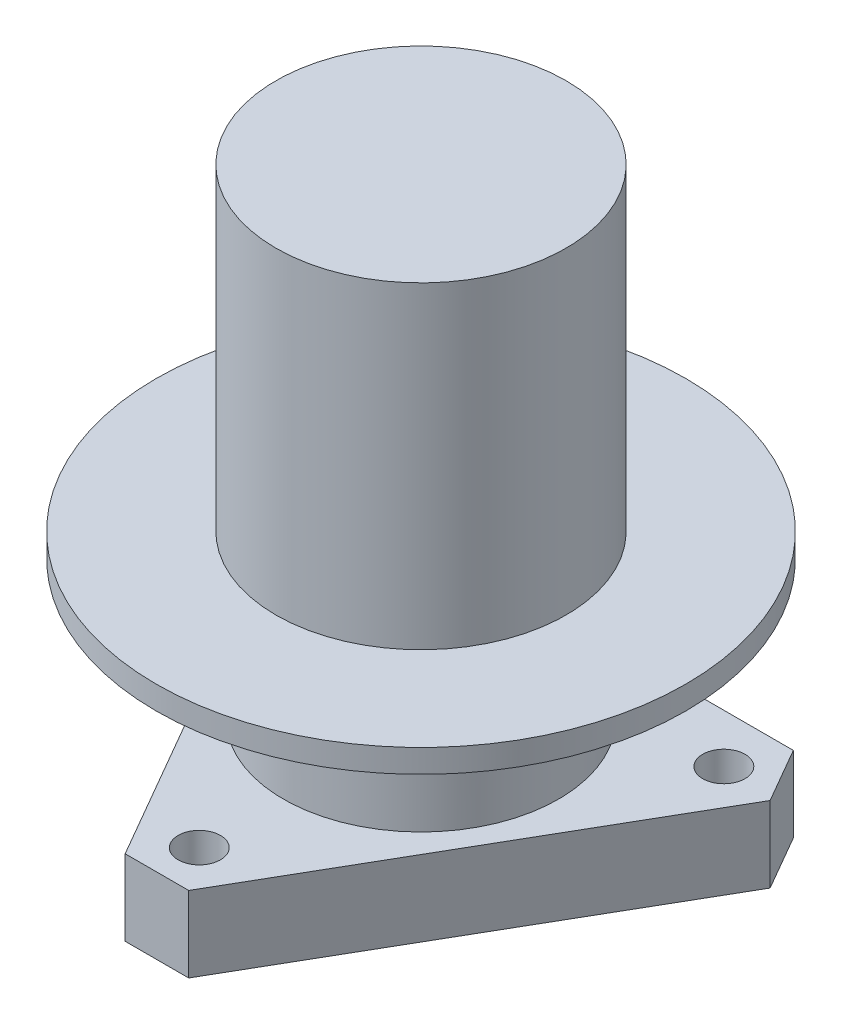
ISO-10303-21;
HEADER;
FILE_DESCRIPTION(('STEP AP214'),'2;1');
FILE_NAME('part.step','',(''),(''),'','','');
FILE_SCHEMA(('AUTOMOTIVE_DESIGN { 1 0 10303 214 1 1 1 1 }'));
ENDSEC;
DATA;
#1=APPLICATION_CONTEXT('core data for automotive mechanical design processes');
#2=APPLICATION_PROTOCOL_DEFINITION('international standard','automotive_design',2000,#1);
#3=PRODUCT_CONTEXT('',#1,'mechanical');
#4=PRODUCT('Part','Part','',(#3));
#5=PRODUCT_RELATED_PRODUCT_CATEGORY('part','',(#4));
#6=PRODUCT_DEFINITION_FORMATION('','',#4);
#7=PRODUCT_DEFINITION_CONTEXT('part definition',#1,'design');
#8=PRODUCT_DEFINITION('design','',#6,#7);
#9=PRODUCT_DEFINITION_SHAPE('','',#8);
#10=(LENGTH_UNIT() NAMED_UNIT(*) SI_UNIT(.MILLI.,.METRE.));
#11=(NAMED_UNIT(*) PLANE_ANGLE_UNIT() SI_UNIT($,.RADIAN.));
#12=(NAMED_UNIT(*) SI_UNIT($,.STERADIAN.) SOLID_ANGLE_UNIT());
#13=UNCERTAINTY_MEASURE_WITH_UNIT(LENGTH_MEASURE(1.E-05),#10,'distance_accuracy_value','');
#14=(GEOMETRIC_REPRESENTATION_CONTEXT(3) GLOBAL_UNCERTAINTY_ASSIGNED_CONTEXT((#13)) GLOBAL_UNIT_ASSIGNED_CONTEXT((#10,
#11,#12)) REPRESENTATION_CONTEXT('',''));
#15=CARTESIAN_POINT('',(0.,0.,0.));
#16=DIRECTION('',(0.,0.,1.));
#17=DIRECTION('',(1.,0.,0.));
#18=AXIS2_PLACEMENT_3D('',#15,#16,#17);
#19=CARTESIAN_POINT('',(0.,19.558,0.));
#20=DIRECTION('',(0.,1.,0.));
#21=DIRECTION('',(0.,0.,1.));
#22=AXIS2_PLACEMENT_3D('',#19,#20,#21);
#23=PLANE('',#22);
#24=CARTESIAN_POINT('',(0.,19.558,0.));
#25=DIRECTION('',(0.,1.,0.));
#26=DIRECTION('',(0.,0.,1.));
#27=AXIS2_PLACEMENT_3D('',#24,#25,#26);
#28=CIRCLE('',#27,31.75);
#29=CARTESIAN_POINT('',(0.,19.558,31.75));
#30=VERTEX_POINT('',#29);
#31=EDGE_CURVE('E43',#30,#30,#28,.T.);
#32=ORIENTED_EDGE('',*,*,#31,.T.);
#33=EDGE_LOOP('',(#32));
#34=FACE_BOUND('',#33,.T.);
#35=CARTESIAN_POINT('',(0.,19.558,0.));
#36=DIRECTION('',(0.,1.,0.));
#37=DIRECTION('',(0.,0.,1.));
#38=AXIS2_PLACEMENT_3D('',#35,#36,#37);
#39=CIRCLE('',#38,17.399);
#40=CARTESIAN_POINT('',(0.,19.558,-17.399));
#41=VERTEX_POINT('',#40);
#42=EDGE_CURVE('E148',#41,#41,#39,.T.);
#43=ORIENTED_EDGE('',*,*,#42,.F.);
#44=EDGE_LOOP('',(#43));
#45=FACE_BOUND('',#44,.T.);
#46=ADVANCED_FACE('F34',(#34,#45),#23,.T.);
#47=CARTESIAN_POINT('',(0.,16.764,0.));
#48=DIRECTION('',(0.,-1.,0.));
#49=DIRECTION('',(0.,0.,-1.));
#50=AXIS2_PLACEMENT_3D('',#47,#48,#49);
#51=CYLINDRICAL_SURFACE('',#50,16.51);
#52=CARTESIAN_POINT('',(0.,16.764,0.));
#53=DIRECTION('',(0.,1.,0.));
#54=DIRECTION('',(0.,0.,1.));
#55=AXIS2_PLACEMENT_3D('',#52,#53,#54);
#56=CIRCLE('',#55,16.51);
#57=CARTESIAN_POINT('',(0.,16.764,16.51));
#58=VERTEX_POINT('',#57);
#59=EDGE_CURVE('E11',#58,#58,#56,.T.);
#60=ORIENTED_EDGE('',*,*,#59,.F.);
#61=EDGE_LOOP('',(#60));
#62=FACE_BOUND('',#61,.T.);
#63=CARTESIAN_POINT('',(0.,0.,0.));
#64=DIRECTION('',(0.,-1.,0.));
#65=DIRECTION('',(0.,0.,-1.));
#66=AXIS2_PLACEMENT_3D('',#63,#64,#65);
#67=CIRCLE('',#66,16.51);
#68=CARTESIAN_POINT('',(0.,0.,-16.51));
#69=VERTEX_POINT('',#68);
#70=EDGE_CURVE('E140',#69,#69,#67,.T.);
#71=ORIENTED_EDGE('',*,*,#70,.F.);
#72=EDGE_LOOP('',(#71));
#73=FACE_BOUND('',#72,.T.);
#74=ADVANCED_FACE('F36',(#62,#73),#51,.T.);
#75=CARTESIAN_POINT('',(0.,16.764,0.));
#76=DIRECTION('',(0.,1.,0.));
#77=DIRECTION('',(0.,0.,1.));
#78=AXIS2_PLACEMENT_3D('',#75,#76,#77);
#79=PLANE('',#78);
#80=CARTESIAN_POINT('',(0.,16.764,0.));
#81=DIRECTION('',(0.,1.,0.));
#82=DIRECTION('',(0.,0.,1.));
#83=AXIS2_PLACEMENT_3D('',#80,#81,#82);
#84=CIRCLE('',#83,31.75);
#85=CARTESIAN_POINT('',(0.,16.764,31.75));
#86=VERTEX_POINT('',#85);
#87=EDGE_CURVE('E154',#86,#86,#84,.T.);
#88=ORIENTED_EDGE('',*,*,#87,.F.);
#89=EDGE_LOOP('',(#88));
#90=FACE_BOUND('',#89,.T.);
#91=ORIENTED_EDGE('',*,*,#59,.T.);
#92=EDGE_LOOP('',(#91));
#93=FACE_BOUND('',#92,.T.);
#94=ADVANCED_FACE('F165',(#90,#93),#79,.F.);
#95=CARTESIAN_POINT('',(0.,19.558,0.));
#96=DIRECTION('',(0.,-1.,0.));
#97=DIRECTION('',(0.,0.,-1.));
#98=AXIS2_PLACEMENT_3D('',#95,#96,#97);
#99=CYLINDRICAL_SURFACE('',#98,31.75);
#100=ORIENTED_EDGE('',*,*,#31,.F.);
#101=EDGE_LOOP('',(#100));
#102=FACE_BOUND('',#101,.T.);
#103=ORIENTED_EDGE('',*,*,#87,.T.);
#104=EDGE_LOOP('',(#103));
#105=FACE_BOUND('',#104,.T.);
#106=ADVANCED_FACE('F161',(#102,#105),#99,.T.);
#107=CARTESIAN_POINT('',(0.,57.658,0.));
#108=DIRECTION('',(0.,-1.,0.));
#109=DIRECTION('',(0.,0.,-1.));
#110=AXIS2_PLACEMENT_3D('',#107,#108,#109);
#111=CYLINDRICAL_SURFACE('',#110,17.399);
#112=CARTESIAN_POINT('',(0.,57.658,0.));
#113=DIRECTION('',(0.,1.,0.));
#114=DIRECTION('',(0.,0.,1.));
#115=AXIS2_PLACEMENT_3D('',#112,#113,#114);
#116=CIRCLE('',#115,17.399);
#117=CARTESIAN_POINT('',(0.,57.658,-17.399));
#118=VERTEX_POINT('',#117);
#119=EDGE_CURVE('E151',#118,#118,#116,.T.);
#120=CARTESIAN_POINT('',(0.,57.658,-17.399));
#121=CARTESIAN_POINT('',(0.,57.261125,-17.399));
#122=CARTESIAN_POINT('',(0.,56.86425,-17.399));
#123=CARTESIAN_POINT('',(0.,56.0705,-17.399));
#124=CARTESIAN_POINT('',(0.,55.673625,-17.399));
#125=CARTESIAN_POINT('',(0.,54.879875,-17.399));
#126=CARTESIAN_POINT('',(0.,54.483,-17.399));
#127=CARTESIAN_POINT('',(0.,53.68925,-17.399));
#128=CARTESIAN_POINT('',(0.,53.292375,-17.399));
#129=CARTESIAN_POINT('',(0.,52.498625,-17.399));
#130=CARTESIAN_POINT('',(0.,52.10175,-17.399));
#131=CARTESIAN_POINT('',(0.,51.308,-17.399));
#132=CARTESIAN_POINT('',(0.,50.911125,-17.399));
#133=CARTESIAN_POINT('',(0.,50.117375,-17.399));
#134=CARTESIAN_POINT('',(0.,49.7205,-17.399));
#135=CARTESIAN_POINT('',(0.,48.92675,-17.399));
#136=CARTESIAN_POINT('',(0.,48.529875,-17.399));
#137=CARTESIAN_POINT('',(0.,47.736125,-17.399));
#138=CARTESIAN_POINT('',(0.,47.33925,-17.399));
#139=CARTESIAN_POINT('',(0.,46.5455,-17.399));
#140=CARTESIAN_POINT('',(0.,46.148625,-17.399));
#141=CARTESIAN_POINT('',(0.,45.354875,-17.399));
#142=CARTESIAN_POINT('',(0.,44.958,-17.399));
#143=CARTESIAN_POINT('',(0.,44.16425,-17.399));
#144=CARTESIAN_POINT('',(0.,43.767375,-17.399));
#145=CARTESIAN_POINT('',(0.,42.973625,-17.399));
#146=CARTESIAN_POINT('',(0.,42.57675,-17.399));
#147=CARTESIAN_POINT('',(0.,41.783,-17.399));
#148=CARTESIAN_POINT('',(0.,41.386125,-17.399));
#149=CARTESIAN_POINT('',(0.,40.592375,-17.399));
#150=CARTESIAN_POINT('',(0.,40.1955,-17.399));
#151=CARTESIAN_POINT('',(0.,39.40175,-17.399));
#152=CARTESIAN_POINT('',(0.,39.004875,-17.399));
#153=CARTESIAN_POINT('',(0.,38.211125,-17.399));
#154=CARTESIAN_POINT('',(0.,37.81425,-17.399));
#155=CARTESIAN_POINT('',(0.,37.0205,-17.399));
#156=CARTESIAN_POINT('',(0.,36.623625,-17.399));
#157=CARTESIAN_POINT('',(0.,35.829875,-17.399));
#158=CARTESIAN_POINT('',(0.,35.433,-17.399));
#159=CARTESIAN_POINT('',(0.,34.63925,-17.399));
#160=CARTESIAN_POINT('',(0.,34.242375,-17.399));
#161=CARTESIAN_POINT('',(0.,33.448625,-17.399));
#162=CARTESIAN_POINT('',(0.,33.05175,-17.399));
#163=CARTESIAN_POINT('',(0.,32.258,-17.399));
#164=CARTESIAN_POINT('',(0.,31.861125,-17.399));
#165=CARTESIAN_POINT('',(0.,31.067375,-17.399));
#166=CARTESIAN_POINT('',(0.,30.6705,-17.399));
#167=CARTESIAN_POINT('',(0.,29.87675,-17.399));
#168=CARTESIAN_POINT('',(0.,29.479875,-17.399));
#169=CARTESIAN_POINT('',(0.,28.686125,-17.399));
#170=CARTESIAN_POINT('',(0.,28.28925,-17.399));
#171=CARTESIAN_POINT('',(0.,27.4955,-17.399));
#172=CARTESIAN_POINT('',(0.,27.098625,-17.399));
#173=CARTESIAN_POINT('',(0.,26.304875,-17.399));
#174=CARTESIAN_POINT('',(0.,25.908,-17.399));
#175=CARTESIAN_POINT('',(0.,25.11425,-17.399));
#176=CARTESIAN_POINT('',(0.,24.717375,-17.399));
#177=CARTESIAN_POINT('',(0.,23.923625,-17.399));
#178=CARTESIAN_POINT('',(0.,23.52675,-17.399));
#179=CARTESIAN_POINT('',(0.,22.733,-17.399));
#180=CARTESIAN_POINT('',(0.,22.336125,-17.399));
#181=CARTESIAN_POINT('',(0.,21.542375,-17.399));
#182=CARTESIAN_POINT('',(0.,21.1455,-17.399));
#183=CARTESIAN_POINT('',(0.,20.35175,-17.399));
#184=CARTESIAN_POINT('',(0.,19.954875,-17.399));
#185=CARTESIAN_POINT('',(0.,19.558,-17.399));
#186=B_SPLINE_CURVE_WITH_KNOTS('',3,(#120,#121,#122,#123,#124,#125,#126,#127,#128,#129,#130,
#131,#132,#133,#134,#135,#136,#137,#138,#139,#140,#141,#142,#143,#144,#145,#146,#147,#148,#149,
#150,#151,#152,#153,#154,#155,#156,#157,#158,#159,#160,#161,#162,#163,#164,#165,#166,#167,#168,
#169,#170,#171,#172,#173,#174,#175,#176,#177,#178,#179,#180,#181,#182,#183,#184,#185),
.UNSPECIFIED.,.F.,.F.,(4,2,2,2,2,2,2,2,2,2,2,2,2,2,2,2,2,2,2,2,2,2,2,2,2,2,2,2,2,2,2,2,4),(0.,
1.19062499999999,2.38124999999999,3.571875,4.7625,5.953125,7.14375,8.334375,9.525,10.715625,
11.90625,13.096875,14.2875,15.478125,16.66875,17.859375,19.05,20.240625,21.43125,22.621875,
23.8125,25.003125,26.19375,27.384375,28.575,29.765625,30.95625,32.146875,33.3375,34.528125,
35.71875,36.909375,38.1),.UNSPECIFIED.);
#187=EDGE_CURVE('BSEAM164',#118,#41,#186,.T.);
#188=ORIENTED_EDGE('',*,*,#119,.F.);
#189=ORIENTED_EDGE('',*,*,#42,.T.);
#190=ORIENTED_EDGE('',*,*,#187,.T.);
#191=ORIENTED_EDGE('',*,*,#187,.F.);
#192=EDGE_LOOP('',(#188,#190,#189,#191));
#193=FACE_BOUND('',#192,.T.);
#194=ADVANCED_FACE('F164',(#193),#111,.T.);
#195=CARTESIAN_POINT('',(0.,57.658,0.));
#196=DIRECTION('',(0.,1.,0.));
#197=DIRECTION('',(0.,0.,1.));
#198=AXIS2_PLACEMENT_3D('',#195,#196,#197);
#199=PLANE('',#198);
#200=ORIENTED_EDGE('',*,*,#119,.T.);
#201=EDGE_LOOP('',(#200));
#202=FACE_BOUND('',#201,.T.);
#203=ADVANCED_FACE('F180',(#202),#199,.T.);
#204=CARTESIAN_POINT('',(0.,0.,-63.3339242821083));
#205=DIRECTION('',(0.,-1.,0.));
#206=DIRECTION('',(0.,0.,-1.));
#207=AXIS2_PLACEMENT_3D('',#204,#205,#206);
#208=PLANE('',#207);
#209=CARTESIAN_POINT('',(23.0249846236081,0.,-13.2934810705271));
#210=DIRECTION('',(0.,-1.,0.));
#211=DIRECTION('',(0.,0.,-1.));
#212=AXIS2_PLACEMENT_3D('',#209,#210,#211);
#213=CIRCLE('',#212,2.54);
#214=CARTESIAN_POINT('',(23.0249846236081,0.,-15.8334810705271));
#215=VERTEX_POINT('',#214);
#216=EDGE_CURVE('E231',#215,#215,#213,.F.);
#217=ORIENTED_EDGE('',*,*,#216,.F.);
#218=EDGE_LOOP('',(#217));
#219=FACE_BOUND('',#218,.T.);
#220=CARTESIAN_POINT('',(-23.0249846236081,0.,-13.2934810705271));
#221=DIRECTION('',(0.,-1.,0.));
#222=DIRECTION('',(0.,0.,-1.));
#223=AXIS2_PLACEMENT_3D('',#220,#221,#222);
#224=CIRCLE('',#223,2.54);
#225=CARTESIAN_POINT('',(-23.0249846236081,0.,-15.8334810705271));
#226=VERTEX_POINT('',#225);
#227=EDGE_CURVE('E225',#226,#226,#224,.F.);
#228=ORIENTED_EDGE('',*,*,#227,.F.);
#229=EDGE_LOOP('',(#228));
#230=FACE_BOUND('',#229,.T.);
#231=CARTESIAN_POINT('',(0.,0.,26.5869621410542));
#232=DIRECTION('',(0.,-1.,0.));
#233=DIRECTION('',(0.,0.,-1.));
#234=AXIS2_PLACEMENT_3D('',#231,#232,#233);
#235=CIRCLE('',#234,2.54);
#236=CARTESIAN_POINT('',(0.,0.,24.0469621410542));
#237=VERTEX_POINT('',#236);
#238=EDGE_CURVE('E126',#237,#237,#235,.F.);
#239=ORIENTED_EDGE('',*,*,#238,.F.);
#240=EDGE_LOOP('',(#239));
#241=FACE_BOUND('',#240,.T.);
#242=DIRECTION('',(-0.5,0.,0.866025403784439));
#243=VECTOR('',#242,1.);
#244=CARTESIAN_POINT('',(-29.329393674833,0.,-12.5339242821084));
#245=LINE('',#244,#243);
#246=CARTESIAN_POINT('',(-25.519393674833,0.,-19.1330378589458));
#247=VERTEX_POINT('',#246);
#248=CARTESIAN_POINT('',(-29.329393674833,0.,-12.5339242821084));
#249=VERTEX_POINT('',#248);
#250=EDGE_CURVE('E122',#247,#249,#245,.T.);
#251=ORIENTED_EDGE('',*,*,#250,.T.);
#252=DIRECTION('',(0.5,0.,0.866025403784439));
#253=VECTOR('',#252,1.);
#254=CARTESIAN_POINT('',(-29.329393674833,0.,-12.5339242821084));
#255=LINE('',#254,#253);
#256=CARTESIAN_POINT('',(-3.81000000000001,0.,31.6669621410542));
#257=VERTEX_POINT('',#256);
#258=EDGE_CURVE('E125',#249,#257,#255,.T.);
#259=ORIENTED_EDGE('',*,*,#258,.T.);
#260=DIRECTION('',(1.,0.,0.));
#261=VECTOR('',#260,1.);
#262=CARTESIAN_POINT('',(-3.81000000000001,0.,31.6669621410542));
#263=LINE('',#262,#261);
#264=CARTESIAN_POINT('',(3.80999999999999,0.,31.6669621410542));
#265=VERTEX_POINT('',#264);
#266=EDGE_CURVE('E129',#257,#265,#263,.T.);
#267=ORIENTED_EDGE('',*,*,#266,.T.);
#268=DIRECTION('',(0.5,0.,-0.866025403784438));
#269=VECTOR('',#268,1.);
#270=CARTESIAN_POINT('',(3.80999999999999,0.,31.6669621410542));
#271=LINE('',#270,#269);
#272=CARTESIAN_POINT('',(29.329393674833,0.,-12.5339242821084));
#273=VERTEX_POINT('',#272);
#274=EDGE_CURVE('E132',#265,#273,#271,.T.);
#275=ORIENTED_EDGE('',*,*,#274,.T.);
#276=DIRECTION('',(-0.500000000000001,0.,-0.866025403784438));
#277=VECTOR('',#276,1.);
#278=CARTESIAN_POINT('',(25.519393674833,0.,-19.1330378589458));
#279=LINE('',#278,#277);
#280=CARTESIAN_POINT('',(25.519393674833,0.,-19.1330378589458));
#281=VERTEX_POINT('',#280);
#282=EDGE_CURVE('E99',#273,#281,#279,.T.);
#283=ORIENTED_EDGE('',*,*,#282,.T.);
#284=DIRECTION('',(-1.,0.,0.));
#285=VECTOR('',#284,1.);
#286=CARTESIAN_POINT('',(-25.519393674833,0.,-19.1330378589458));
#287=LINE('',#286,#285);
#288=EDGE_CURVE('E135',#281,#247,#287,.T.);
#289=ORIENTED_EDGE('',*,*,#288,.T.);
#290=EDGE_LOOP('',(#251,#259,#267,#275,#283,#289));
#291=FACE_BOUND('',#290,.T.);
#292=ORIENTED_EDGE('',*,*,#70,.T.);
#293=EDGE_LOOP('',(#292));
#294=FACE_BOUND('',#293,.T.);
#295=ADVANCED_FACE('F177',(#219,#230,#241,#291,#294),#208,.F.);
#296=CARTESIAN_POINT('',(-29.329393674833,-9.0932,-12.5339242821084));
#297=DIRECTION('',(-0.866025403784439,0.,-0.5));
#298=DIRECTION('',(-0.5,0.,0.866025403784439));
#299=AXIS2_PLACEMENT_3D('',#296,#297,#298);
#300=PLANE('',#299);
#301=ORIENTED_EDGE('',*,*,#250,.F.);
#302=DIRECTION('',(0.,1.,0.));
#303=VECTOR('',#302,1.);
#304=CARTESIAN_POINT('',(-25.519393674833,-9.0932,-19.1330378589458));
#305=LINE('',#304,#303);
#306=CARTESIAN_POINT('',(-25.519393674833,-9.0932,-19.1330378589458));
#307=VERTEX_POINT('',#306);
#308=EDGE_CURVE('E51',#307,#247,#305,.T.);
#309=ORIENTED_EDGE('',*,*,#308,.F.);
#310=DIRECTION('',(-0.5,0.,0.866025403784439));
#311=VECTOR('',#310,1.);
#312=CARTESIAN_POINT('',(-29.329393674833,-9.0932,-12.5339242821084));
#313=LINE('',#312,#311);
#314=CARTESIAN_POINT('',(-29.329393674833,-9.0932,-12.5339242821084));
#315=VERTEX_POINT('',#314);
#316=EDGE_CURVE('E138',#307,#315,#313,.T.);
#317=ORIENTED_EDGE('',*,*,#316,.T.);
#318=DIRECTION('',(0.,1.,0.));
#319=VECTOR('',#318,1.);
#320=CARTESIAN_POINT('',(-29.329393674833,-9.0932,-12.5339242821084));
#321=LINE('',#320,#319);
#322=EDGE_CURVE('E86',#315,#249,#321,.T.);
#323=ORIENTED_EDGE('',*,*,#322,.T.);
#324=EDGE_LOOP('',(#301,#309,#317,#323));
#325=FACE_BOUND('',#324,.T.);
#326=ADVANCED_FACE('F179',(#325),#300,.T.);
#327=CARTESIAN_POINT('',(-25.519393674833,-9.0932,-19.1330378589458));
#328=DIRECTION('',(0.,0.,-1.));
#329=DIRECTION('',(-1.,0.,0.));
#330=AXIS2_PLACEMENT_3D('',#327,#328,#329);
#331=PLANE('',#330);
#332=ORIENTED_EDGE('',*,*,#288,.F.);
#333=DIRECTION('',(0.,1.,0.));
#334=VECTOR('',#333,1.);
#335=CARTESIAN_POINT('',(25.519393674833,-9.0932,-19.1330378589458));
#336=LINE('',#335,#334);
#337=CARTESIAN_POINT('',(25.519393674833,-9.0932,-19.1330378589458));
#338=VERTEX_POINT('',#337);
#339=EDGE_CURVE('E74',#338,#281,#336,.T.);
#340=ORIENTED_EDGE('',*,*,#339,.F.);
#341=DIRECTION('',(-1.,0.,0.));
#342=VECTOR('',#341,1.);
#343=CARTESIAN_POINT('',(-25.519393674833,-9.0932,-19.1330378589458));
#344=LINE('',#343,#342);
#345=EDGE_CURVE('E112',#338,#307,#344,.T.);
#346=ORIENTED_EDGE('',*,*,#345,.T.);
#347=ORIENTED_EDGE('',*,*,#308,.T.);
#348=EDGE_LOOP('',(#332,#340,#346,#347));
#349=FACE_BOUND('',#348,.T.);
#350=ADVANCED_FACE('F187',(#349),#331,.T.);
#351=CARTESIAN_POINT('',(25.519393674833,-9.0932,-19.1330378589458));
#352=DIRECTION('',(0.866025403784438,0.,-0.500000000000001));
#353=DIRECTION('',(-0.500000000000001,0.,-0.866025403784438));
#354=AXIS2_PLACEMENT_3D('',#351,#352,#353);
#355=PLANE('',#354);
#356=ORIENTED_EDGE('',*,*,#282,.F.);
#357=DIRECTION('',(0.,1.,0.));
#358=VECTOR('',#357,1.);
#359=CARTESIAN_POINT('',(29.329393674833,-9.0932,-12.5339242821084));
#360=LINE('',#359,#358);
#361=CARTESIAN_POINT('',(29.329393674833,-9.0932,-12.5339242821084));
#362=VERTEX_POINT('',#361);
#363=EDGE_CURVE('E94',#362,#273,#360,.T.);
#364=ORIENTED_EDGE('',*,*,#363,.F.);
#365=DIRECTION('',(-0.500000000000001,0.,-0.866025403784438));
#366=VECTOR('',#365,1.);
#367=CARTESIAN_POINT('',(25.519393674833,-9.0932,-19.1330378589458));
#368=LINE('',#367,#366);
#369=EDGE_CURVE('E97',#362,#338,#368,.T.);
#370=ORIENTED_EDGE('',*,*,#369,.T.);
#371=ORIENTED_EDGE('',*,*,#339,.T.);
#372=EDGE_LOOP('',(#356,#364,#370,#371));
#373=FACE_BOUND('',#372,.T.);
#374=ADVANCED_FACE('F96',(#373),#355,.T.);
#375=CARTESIAN_POINT('',(3.80999999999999,-9.0932,31.6669621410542));
#376=DIRECTION('',(0.866025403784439,0.,0.5));
#377=DIRECTION('',(0.5,0.,-0.866025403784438));
#378=AXIS2_PLACEMENT_3D('',#375,#376,#377);
#379=PLANE('',#378);
#380=ORIENTED_EDGE('',*,*,#274,.F.);
#381=DIRECTION('',(0.,1.,0.));
#382=VECTOR('',#381,1.);
#383=CARTESIAN_POINT('',(3.80999999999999,-9.0932,31.6669621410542));
#384=LINE('',#383,#382);
#385=CARTESIAN_POINT('',(3.80999999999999,-9.0932,31.6669621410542));
#386=VERTEX_POINT('',#385);
#387=EDGE_CURVE('E104',#386,#265,#384,.T.);
#388=ORIENTED_EDGE('',*,*,#387,.F.);
#389=DIRECTION('',(0.5,0.,-0.866025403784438));
#390=VECTOR('',#389,1.);
#391=CARTESIAN_POINT('',(3.80999999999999,-9.0932,31.6669621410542));
#392=LINE('',#391,#390);
#393=EDGE_CURVE('E110',#386,#362,#392,.T.);
#394=ORIENTED_EDGE('',*,*,#393,.T.);
#395=ORIENTED_EDGE('',*,*,#363,.T.);
#396=EDGE_LOOP('',(#380,#388,#394,#395));
#397=FACE_BOUND('',#396,.T.);
#398=ADVANCED_FACE('F114',(#397),#379,.T.);
#399=CARTESIAN_POINT('',(-3.81000000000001,-9.0932,31.6669621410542));
#400=DIRECTION('',(0.,0.,1.));
#401=DIRECTION('',(1.,0.,0.));
#402=AXIS2_PLACEMENT_3D('',#399,#400,#401);
#403=PLANE('',#402);
#404=ORIENTED_EDGE('',*,*,#266,.F.);
#405=DIRECTION('',(0.,1.,0.));
#406=VECTOR('',#405,1.);
#407=CARTESIAN_POINT('',(-3.81000000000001,-9.0932,31.6669621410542));
#408=LINE('',#407,#406);
#409=CARTESIAN_POINT('',(-3.81000000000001,-9.0932,31.6669621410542));
#410=VERTEX_POINT('',#409);
#411=EDGE_CURVE('E143',#410,#257,#408,.T.);
#412=ORIENTED_EDGE('',*,*,#411,.F.);
#413=DIRECTION('',(1.,0.,0.));
#414=VECTOR('',#413,1.);
#415=CARTESIAN_POINT('',(-3.81000000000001,-9.0932,31.6669621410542));
#416=LINE('',#415,#414);
#417=EDGE_CURVE('E115',#410,#386,#416,.T.);
#418=ORIENTED_EDGE('',*,*,#417,.T.);
#419=ORIENTED_EDGE('',*,*,#387,.T.);
#420=EDGE_LOOP('',(#404,#412,#418,#419));
#421=FACE_BOUND('',#420,.T.);
#422=ADVANCED_FACE('F206',(#421),#403,.T.);
#423=CARTESIAN_POINT('',(-29.329393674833,-9.0932,-12.5339242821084));
#424=DIRECTION('',(-0.866025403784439,0.,0.5));
#425=DIRECTION('',(0.5,0.,0.866025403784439));
#426=AXIS2_PLACEMENT_3D('',#423,#424,#425);
#427=PLANE('',#426);
#428=ORIENTED_EDGE('',*,*,#258,.F.);
#429=ORIENTED_EDGE('',*,*,#322,.F.);
#430=DIRECTION('',(0.5,0.,0.866025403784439));
#431=VECTOR('',#430,1.);
#432=CARTESIAN_POINT('',(-29.329393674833,-9.0932,-12.5339242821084));
#433=LINE('',#432,#431);
#434=EDGE_CURVE('E117',#315,#410,#433,.T.);
#435=ORIENTED_EDGE('',*,*,#434,.T.);
#436=ORIENTED_EDGE('',*,*,#411,.T.);
#437=EDGE_LOOP('',(#428,#429,#435,#436));
#438=FACE_BOUND('',#437,.T.);
#439=ADVANCED_FACE('F203',(#438),#427,.T.);
#440=CARTESIAN_POINT('',(0.,-9.0932,-63.3339242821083));
#441=DIRECTION('',(0.,-1.,0.));
#442=DIRECTION('',(0.,0.,-1.));
#443=AXIS2_PLACEMENT_3D('',#440,#441,#442);
#444=PLANE('',#443);
#445=CARTESIAN_POINT('',(23.0249846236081,-9.0932,-13.2934810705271));
#446=DIRECTION('',(0.,-1.,0.));
#447=DIRECTION('',(0.,0.,-1.));
#448=AXIS2_PLACEMENT_3D('',#445,#446,#447);
#449=CIRCLE('',#448,2.54);
#450=CARTESIAN_POINT('',(23.0249846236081,-9.0932,-15.8334810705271));
#451=VERTEX_POINT('',#450);
#452=EDGE_CURVE('E234',#451,#451,#449,.T.);
#453=ORIENTED_EDGE('',*,*,#452,.F.);
#454=EDGE_LOOP('',(#453));
#455=FACE_BOUND('',#454,.T.);
#456=CARTESIAN_POINT('',(-23.0249846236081,-9.0932,-13.2934810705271));
#457=DIRECTION('',(0.,-1.,0.));
#458=DIRECTION('',(0.,0.,1.));
#459=AXIS2_PLACEMENT_3D('',#456,#457,#458);
#460=CIRCLE('',#459,2.54);
#461=CARTESIAN_POINT('',(-23.0249846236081,-9.0932,-10.7534810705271));
#462=VERTEX_POINT('',#461);
#463=EDGE_CURVE('E228',#462,#462,#460,.T.);
#464=ORIENTED_EDGE('',*,*,#463,.F.);
#465=EDGE_LOOP('',(#464));
#466=FACE_BOUND('',#465,.T.);
#467=CARTESIAN_POINT('',(0.,-9.0932,26.5869621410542));
#468=DIRECTION('',(0.,-1.,0.));
#469=DIRECTION('',(0.,0.,-1.));
#470=AXIS2_PLACEMENT_3D('',#467,#468,#469);
#471=CIRCLE('',#470,2.54);
#472=CARTESIAN_POINT('',(0.,-9.0932,24.0469621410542));
#473=VERTEX_POINT('',#472);
#474=EDGE_CURVE('E222',#473,#473,#471,.T.);
#475=ORIENTED_EDGE('',*,*,#474,.F.);
#476=EDGE_LOOP('',(#475));
#477=FACE_BOUND('',#476,.T.);
#478=ORIENTED_EDGE('',*,*,#316,.F.);
#479=ORIENTED_EDGE('',*,*,#345,.F.);
#480=ORIENTED_EDGE('',*,*,#369,.F.);
#481=ORIENTED_EDGE('',*,*,#393,.F.);
#482=ORIENTED_EDGE('',*,*,#417,.F.);
#483=ORIENTED_EDGE('',*,*,#434,.F.);
#484=EDGE_LOOP('',(#478,#479,#480,#481,#482,#483));
#485=FACE_BOUND('',#484,.T.);
#486=ADVANCED_FACE('F108',(#455,#466,#477,#485),#444,.T.);
#487=CARTESIAN_POINT('',(0.,7.18420489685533,26.5869621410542));
#488=DIRECTION('',(0.,-1.,0.));
#489=DIRECTION('',(0.,0.,-1.));
#490=AXIS2_PLACEMENT_3D('',#487,#488,#489);
#491=CYLINDRICAL_SURFACE('',#490,2.54);
#492=ORIENTED_EDGE('',*,*,#238,.T.);
#493=EDGE_LOOP('',(#492));
#494=FACE_BOUND('',#493,.T.);
#495=ORIENTED_EDGE('',*,*,#474,.T.);
#496=EDGE_LOOP('',(#495));
#497=FACE_BOUND('',#496,.T.);
#498=ADVANCED_FACE('F242',(#494,#497),#491,.F.);
#499=CARTESIAN_POINT('',(-23.0249846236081,7.18420489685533,-13.2934810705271));
#500=DIRECTION('',(0.,-1.,0.));
#501=DIRECTION('',(0.,0.,-1.));
#502=AXIS2_PLACEMENT_3D('',#499,#500,#501);
#503=CYLINDRICAL_SURFACE('',#502,2.54);
#504=ORIENTED_EDGE('',*,*,#227,.T.);
#505=EDGE_LOOP('',(#504));
#506=FACE_BOUND('',#505,.T.);
#507=ORIENTED_EDGE('',*,*,#463,.T.);
#508=EDGE_LOOP('',(#507));
#509=FACE_BOUND('',#508,.T.);
#510=ADVANCED_FACE('F248',(#506,#509),#503,.F.);
#511=CARTESIAN_POINT('',(23.0249846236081,7.18420489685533,-13.2934810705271));
#512=DIRECTION('',(0.,-1.,0.));
#513=DIRECTION('',(0.,0.,-1.));
#514=AXIS2_PLACEMENT_3D('',#511,#512,#513);
#515=CYLINDRICAL_SURFACE('',#514,2.54);
#516=ORIENTED_EDGE('',*,*,#216,.T.);
#517=EDGE_LOOP('',(#516));
#518=FACE_BOUND('',#517,.T.);
#519=ORIENTED_EDGE('',*,*,#452,.T.);
#520=EDGE_LOOP('',(#519));
#521=FACE_BOUND('',#520,.T.);
#522=ADVANCED_FACE('F238',(#518,#521),#515,.F.);
#523=CLOSED_SHELL('',(#46,#74,#94,#106,#194,#203,#295,#326,#350,#374,#398,#422,#439,#486,#498,
#510,#522));
#524=MANIFOLD_SOLID_BREP('B2',#523);
#525=ADVANCED_BREP_SHAPE_REPRESENTATION('',(#18,#524),#14);
#526=SHAPE_DEFINITION_REPRESENTATION(#9,#525);
ENDSEC;
END-ISO-10303-21;
